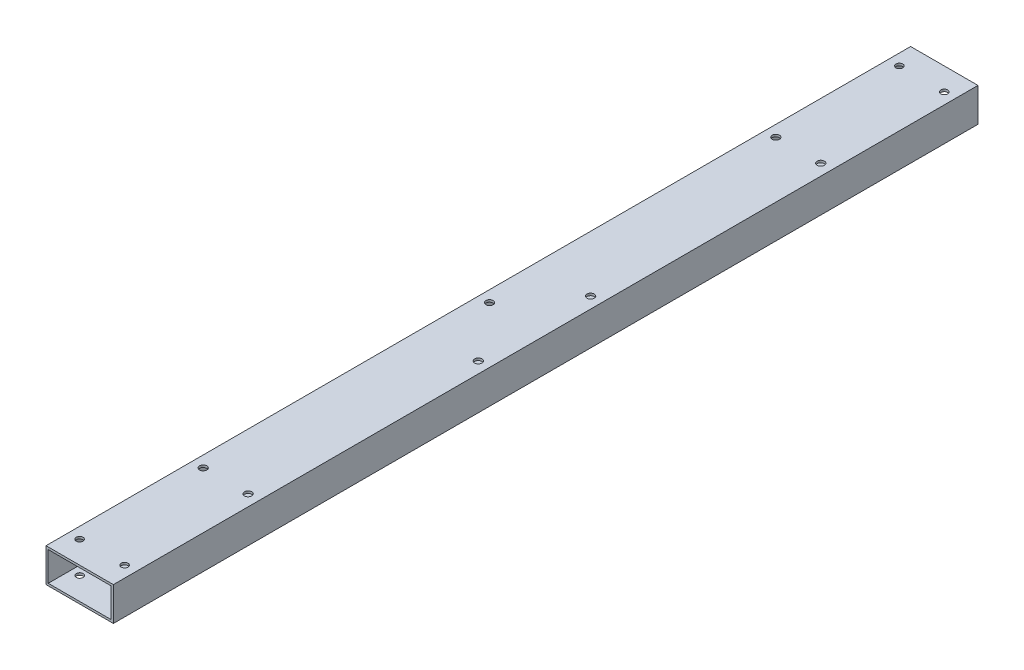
from build123d import *

# Parameters (mm, degrees)
SKETCH1_W           = 60
SKETCH1_H           = 30
SKETCH1_W_2         = 56
SKETCH1_H_2         = 26
BOSS_EXTRUDE1_DEPTH = 385
SKETCH2_R           = 3.05
SKETCH2_R_2         = 3.25
CUT_EXTRUDE1_DEPTH  = 388.330608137
SKETCH3_R           = 8
CUT_EXTRUDE2_DEPTH  = 2


with BuildPart() as part:
    # Sketch1 → Boss-Extrude1 (new, symmetric)
    with BuildSketch(Plane.XY):
        Rectangle(SKETCH1_W, SKETCH1_H)
        Rectangle(SKETCH1_W_2, SKETCH1_H_2, mode=Mode.SUBTRACT)
    extrude(amount=BOSS_EXTRUDE1_DEPTH, both=True)

    # Sketch2 → Cut-Extrude1 (cut, symmetric)
    with BuildSketch(Plane(origin=(0, 15, 0), x_dir=(1, 0, 0), z_dir=(0, 1, 0))):
        with Locations(Location((-20, 365, 0), (0, 0, 90))):
            Circle(SKETCH2_R)
        with Locations(Location((20, 365, 0), (0, 0, 90))):
            Circle(SKETCH2_R)
        with Locations(Location((-20, 255, 0), (0, 0, 90))):
            Circle(SKETCH2_R_2)
        with Locations(Location((20, 255, 0), (0, 0, 90))):
            Circle(SKETCH2_R_2)
        with Locations(Location((-20, 0, 0), (0, 0, 90))):
            Circle(SKETCH2_R_2)
        with Locations(Location((20, 50, 0), (0, 0, 90))):
            Circle(SKETCH2_R_2)
    cut_extrude1 = extrude(amount=CUT_EXTRUDE1_DEPTH, both=True, mode=Mode.SUBTRACT)

    # Sketch3 → Cut-Extrude2 (cut)
    with BuildSketch(Plane(origin=(0, -15, 0), x_dir=(1, 0, 0), z_dir=(0, 1, 0))):
        with Locations((20, 255)):
            Circle(SKETCH3_R)
        with Locations(Location((-20, 255, 0), (0, 0, 180))):
            Circle(SKETCH3_R)
        with Locations((20, 50)):
            Circle(SKETCH3_R)
        with Locations(Location((-20, 0, 0), (0, 0, 180))):
            Circle(SKETCH3_R)
    cut_extrude2 = extrude(amount=CUT_EXTRUDE2_DEPTH, mode=Mode.SUBTRACT)

    # Mirror1: Cut-Extrude1, Cut-Extrude2 across plane
    add(cut_extrude1.mirror(Plane.XY), mode=Mode.SUBTRACT)
    add(cut_extrude2.mirror(Plane.XY), mode=Mode.SUBTRACT)


solid = part.part
